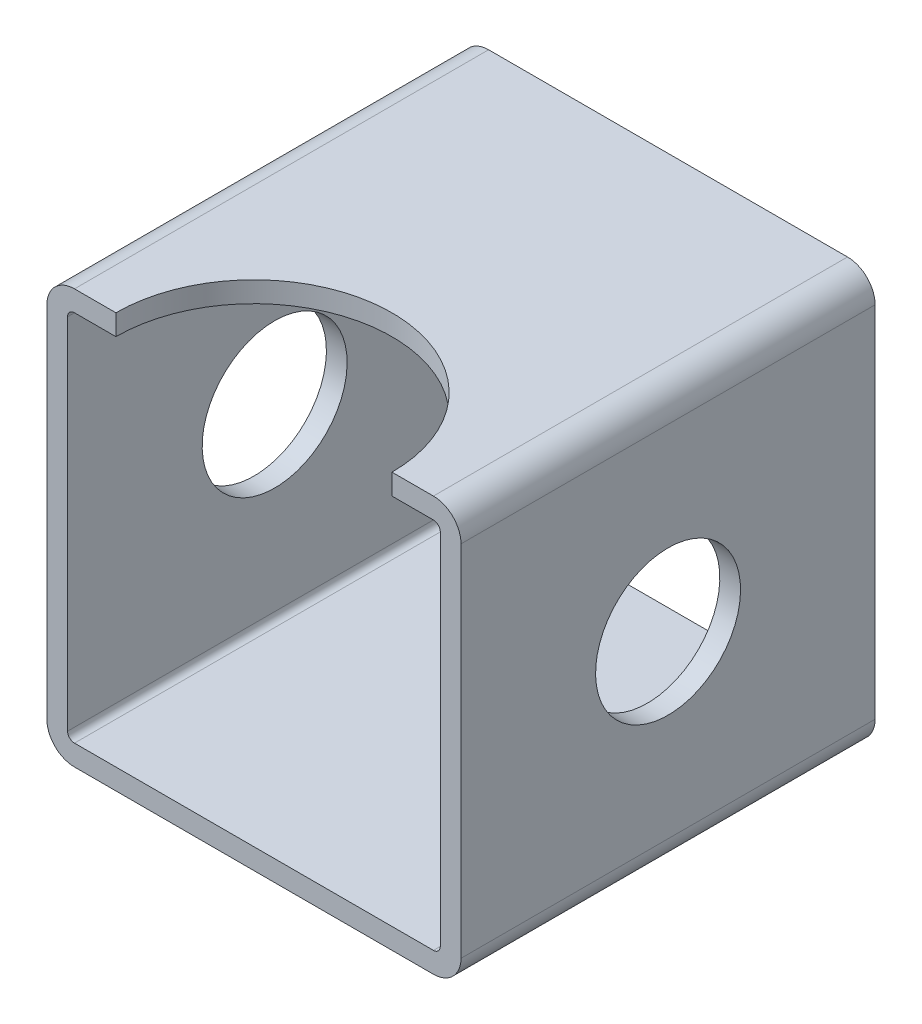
from build123d import *

# Parameters (mm, degrees)
BASE_EXTRUSION_DEPTH    = 60
ESQUISSE2_R             = 20
ENL_V_MAT_EXTRU_1_DEPTH = 5
ESQUISSE3_R             = 10.5
ENL_V_MAT_EXTRU_2_DEPTH = 104.923048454


with BuildPart() as part:
    # Esquisse1 → Base-Extrusion (new body)
    with BuildSketch(Plane.XY):
        with BuildLine():
            Line((4, 0), (56, 0))
            ThreePointArc((56, 0), (58.828427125, -1.171572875), (60, -4))
            Line((60, -4), (60, -56))
            ThreePointArc((60, -56), (58.828427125, -58.828427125), (56, -60))
            Line((56, -60), (4, -60))
            ThreePointArc((4, -60), (1.171572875, -58.828427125), (0, -56))
            Line((0, -56), (0, -4))
            ThreePointArc((0, -4), (1.171572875, -1.171572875), (4, 0))
        make_face()
        with BuildLine():
            Line((4, -3), (56, -3))
            ThreePointArc((56, -3), (56.707106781, -3.292893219), (57, -4))
            Line((57, -4), (57, -56))
            ThreePointArc((57, -56), (56.707106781, -56.707106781), (56, -57))
            Line((56, -57), (4, -57))
            ThreePointArc((4, -57), (3.292893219, -56.707106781), (3, -56))
            Line((3, -56), (3, -4))
            ThreePointArc((3, -4), (3.292893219, -3.292893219), (4, -3))
        make_face(mode=Mode.SUBTRACT)
    extrude(amount=BASE_EXTRUSION_DEPTH)

    # Esquisse2 → Enl_v. mat.-Extru.1 (cut)
    with BuildSketch(Plane(origin=(0, 0, 0), x_dir=(-1, 0, 0), z_dir=(0, 1, 0))):
        with Locations((-30, 60)):
            Circle(ESQUISSE2_R)
    extrude(amount=-ENL_V_MAT_EXTRU_1_DEPTH, mode=Mode.SUBTRACT)

    # Esquisse3 → Enl_v. mat.-Extru.2 (cut, through all)
    with BuildSketch(Plane(origin=(60, 0, 0), x_dir=(0, 0, -1), z_dir=(1, 0, 0))):
        with Locations(Location((-30, -30, 0), (0, 0, 90))):
            Circle(ESQUISSE3_R)
    extrude(amount=-ENL_V_MAT_EXTRU_2_DEPTH, mode=Mode.SUBTRACT)


solid = part.part
